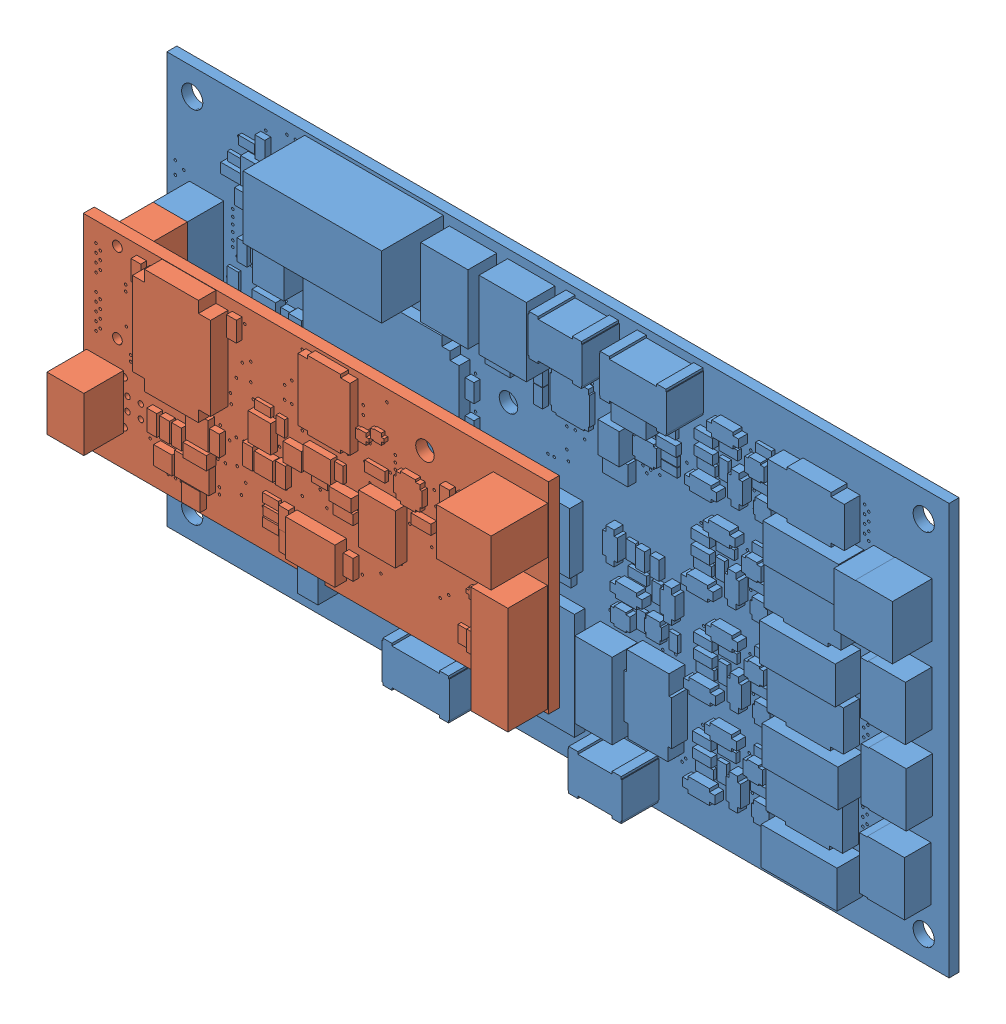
SolidWorks assembly BCBaasy-mPhox+pH.SLDASM, configuration Default (file format 15000). Lengths in mm.
Overall size (117.47 61.72 33.12).
2 component instances, 2 part files, 2 mates.
Components (placement in the parent):
- 100221415ra_mphox_Solid-1: 100221415ra_mphox_Solid.SLDPRT [Default] at origin size (117.47 61.72 25.67)
- 100221250ra_mcap-1: 100221250ra_mcap.SLDPRT [Default] at (0 10.414 12.4054) size (69.85 30.23 15.62)
Mates (geometry in assembly coordinates):
- Concentric1: concentric aligned: cylinder of 100221415ra_mphox_Solid-1 through (51.308 35.433 1.5037) axis (0 0 -1) radius 1.397; cylinder of 100221250ra_mcap-1 through (51.308 35.433 14.0462) axis (0 0 -1) radius 1.397
- Coincident1: coincident anti-aligned: plane of 100221415ra_mphox_Solid-1 through (5.969 32.893 6.9545) normal (0 0 1); plane of 100221250ra_mcap-1 through (5.969 32.893 6.9545) normal (0 0 -1)
